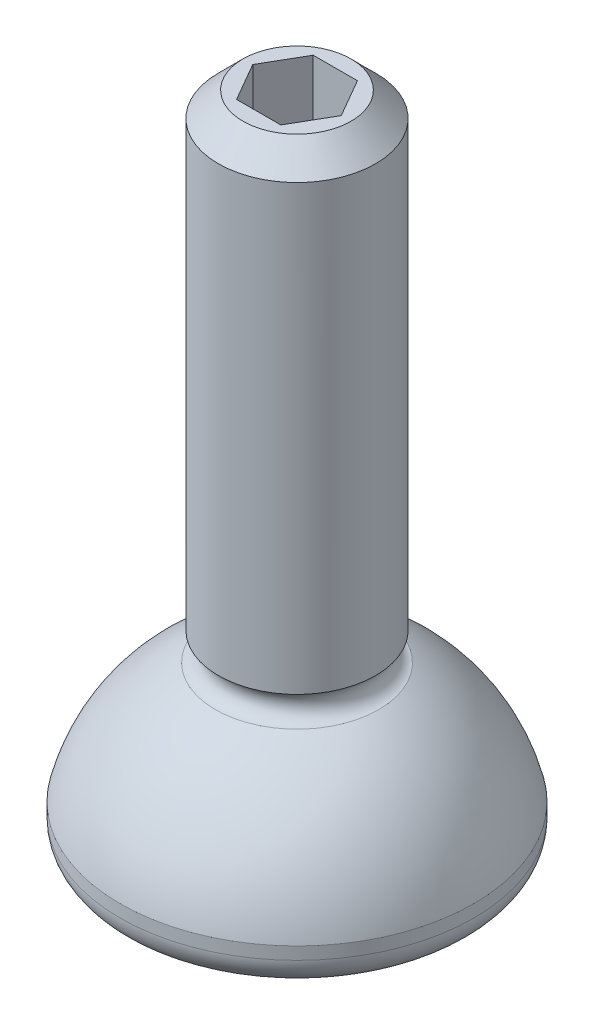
ISO-10303-21;
HEADER;
FILE_DESCRIPTION(('STEP AP214'),'2;1');
FILE_NAME('part.step','',(''),(''),'','','');
FILE_SCHEMA(('AUTOMOTIVE_DESIGN { 1 0 10303 214 1 1 1 1 }'));
ENDSEC;
DATA;
#1=APPLICATION_CONTEXT('core data for automotive mechanical design processes');
#2=APPLICATION_PROTOCOL_DEFINITION('international standard','automotive_design',2000,#1);
#3=PRODUCT_CONTEXT('',#1,'mechanical');
#4=PRODUCT('Part','Part','',(#3));
#5=PRODUCT_RELATED_PRODUCT_CATEGORY('part','',(#4));
#6=PRODUCT_DEFINITION_FORMATION('','',#4);
#7=PRODUCT_DEFINITION_CONTEXT('part definition',#1,'design');
#8=PRODUCT_DEFINITION('design','',#6,#7);
#9=PRODUCT_DEFINITION_SHAPE('','',#8);
#10=(LENGTH_UNIT() NAMED_UNIT(*) SI_UNIT(.MILLI.,.METRE.));
#11=(NAMED_UNIT(*) PLANE_ANGLE_UNIT() SI_UNIT($,.RADIAN.));
#12=(NAMED_UNIT(*) SI_UNIT($,.STERADIAN.) SOLID_ANGLE_UNIT());
#13=UNCERTAINTY_MEASURE_WITH_UNIT(LENGTH_MEASURE(1.E-05),#10,'distance_accuracy_value','');
#14=(GEOMETRIC_REPRESENTATION_CONTEXT(3) GLOBAL_UNCERTAINTY_ASSIGNED_CONTEXT((#13)) GLOBAL_UNIT_ASSIGNED_CONTEXT((#10,
#11,#12)) REPRESENTATION_CONTEXT('',''));
#15=CARTESIAN_POINT('',(0.,0.,0.));
#16=DIRECTION('',(0.,0.,1.));
#17=DIRECTION('',(1.,0.,0.));
#18=AXIS2_PLACEMENT_3D('',#15,#16,#17);
#19=CARTESIAN_POINT('',(3.49148336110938E-12,-1000.,0.));
#20=DIRECTION('',(0.,-1.,0.));
#21=DIRECTION('',(1.,0.,0.));
#22=AXIS2_PLACEMENT_3D('',#19,#20,#21);
#23=CYLINDRICAL_SURFACE('',#22,2.03200000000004);
#24=CARTESIAN_POINT('',(0.,4.92119226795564,0.));
#25=DIRECTION('',(0.,-1.,0.));
#26=DIRECTION('',(1.,0.,0.));
#27=AXIS2_PLACEMENT_3D('',#24,#25,#26);
#28=CIRCLE('',#27,2.03200000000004);
#29=CARTESIAN_POINT('',(2.03200000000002,4.92119226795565,0.));
#30=VERTEX_POINT('',#29);
#31=EDGE_CURVE('E36',#30,#30,#28,.T.);
#32=ORIENTED_EDGE('',*,*,#31,.F.);
#33=EDGE_LOOP('',(#32));
#34=FACE_BOUND('',#33,.T.);
#35=CARTESIAN_POINT('',(0.,16.383,0.));
#36=DIRECTION('',(0.,1.,0.));
#37=DIRECTION('',(-1.,0.,0.));
#38=AXIS2_PLACEMENT_3D('',#35,#36,#37);
#39=CIRCLE('',#38,2.03200000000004);
#40=CARTESIAN_POINT('',(-2.03200000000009,16.383,0.));
#41=VERTEX_POINT('',#40);
#42=EDGE_CURVE('E176',#41,#41,#39,.F.);
#43=ORIENTED_EDGE('',*,*,#42,.T.);
#44=EDGE_LOOP('',(#43));
#45=FACE_BOUND('',#44,.T.);
#46=ADVANCED_FACE('F32',(#34,#45),#23,.T.);
#47=CARTESIAN_POINT('',(2.032,17.018,0.));
#48=DIRECTION('',(0.,1.,0.));
#49=DIRECTION('',(-1.,0.,0.));
#50=AXIS2_PLACEMENT_3D('',#47,#48,#49);
#51=PLANE('',#50);
#52=DIRECTION('',(1.,0.,0.));
#53=VECTOR('',#52,1.);
#54=CARTESIAN_POINT('',(-0.571923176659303,17.018,0.9906));
#55=LINE('',#54,#53);
#56=CARTESIAN_POINT('',(-0.571923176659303,17.018,0.9906));
#57=VERTEX_POINT('',#56);
#58=CARTESIAN_POINT('',(0.571923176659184,17.018,0.9906));
#59=VERTEX_POINT('',#58);
#60=EDGE_CURVE('E154',#57,#59,#55,.T.);
#61=ORIENTED_EDGE('',*,*,#60,.F.);
#62=DIRECTION('',(0.5,0.,0.866025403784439));
#63=VECTOR('',#62,1.);
#64=CARTESIAN_POINT('',(-1.14384635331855,17.018,0.));
#65=LINE('',#64,#63);
#66=CARTESIAN_POINT('',(-1.14384635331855,17.018,0.));
#67=VERTEX_POINT('',#66);
#68=EDGE_CURVE('E152',#67,#57,#65,.T.);
#69=ORIENTED_EDGE('',*,*,#68,.F.);
#70=DIRECTION('',(-0.5,0.,0.866025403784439));
#71=VECTOR('',#70,1.);
#72=CARTESIAN_POINT('',(-0.571923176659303,17.018,-0.9906));
#73=LINE('',#72,#71);
#74=CARTESIAN_POINT('',(-0.571923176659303,17.018,-0.9906));
#75=VERTEX_POINT('',#74);
#76=EDGE_CURVE('E150',#75,#67,#73,.T.);
#77=ORIENTED_EDGE('',*,*,#76,.F.);
#78=DIRECTION('',(-1.,0.,0.));
#79=VECTOR('',#78,1.);
#80=CARTESIAN_POINT('',(0.571923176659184,17.018,-0.9906));
#81=LINE('',#80,#79);
#82=CARTESIAN_POINT('',(0.571923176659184,17.018,-0.9906));
#83=VERTEX_POINT('',#82);
#84=EDGE_CURVE('E147',#83,#75,#81,.T.);
#85=ORIENTED_EDGE('',*,*,#84,.F.);
#86=DIRECTION('',(-0.5,0.,-0.866025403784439));
#87=VECTOR('',#86,1.);
#88=CARTESIAN_POINT('',(1.14384635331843,17.018,0.));
#89=LINE('',#88,#87);
#90=CARTESIAN_POINT('',(1.14384635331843,17.018,0.));
#91=VERTEX_POINT('',#90);
#92=EDGE_CURVE('E118',#91,#83,#89,.T.);
#93=ORIENTED_EDGE('',*,*,#92,.F.);
#94=DIRECTION('',(0.5,0.,-0.866025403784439));
#95=VECTOR('',#94,1.);
#96=CARTESIAN_POINT('',(0.571923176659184,17.018,0.9906));
#97=LINE('',#96,#95);
#98=EDGE_CURVE('E111',#59,#91,#97,.T.);
#99=ORIENTED_EDGE('',*,*,#98,.F.);
#100=EDGE_LOOP('',(#61,#69,#77,#85,#93,#99));
#101=FACE_BOUND('',#100,.T.);
#102=CARTESIAN_POINT('',(0.,17.018,0.));
#103=DIRECTION('',(0.,1.,0.));
#104=DIRECTION('',(-1.,0.,0.));
#105=AXIS2_PLACEMENT_3D('',#102,#103,#104);
#106=CIRCLE('',#105,1.39699999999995);
#107=CARTESIAN_POINT('',(-1.39700000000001,17.018,0.));
#108=VERTEX_POINT('',#107);
#109=EDGE_CURVE('E179',#108,#108,#106,.T.);
#110=ORIENTED_EDGE('',*,*,#109,.T.);
#111=EDGE_LOOP('',(#110));
#112=FACE_BOUND('',#111,.T.);
#113=ADVANCED_FACE('F211',(#101,#112),#51,.T.);
#114=CARTESIAN_POINT('',(0.,16.383,0.));
#115=DIRECTION('',(0.,-1.,0.));
#116=DIRECTION('',(1.,0.,0.));
#117=AXIS2_PLACEMENT_3D('',#114,#115,#116);
#118=CONICAL_SURFACE('',#117,2.03200000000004,0.785398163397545);
#119=ORIENTED_EDGE('',*,*,#109,.F.);
#120=EDGE_LOOP('',(#119));
#121=FACE_BOUND('',#120,.T.);
#122=ORIENTED_EDGE('',*,*,#42,.F.);
#123=EDGE_LOOP('',(#122));
#124=FACE_BOUND('',#123,.T.);
#125=ADVANCED_FACE('F242',(#121,#124),#118,.T.);
#126=CARTESIAN_POINT('',(1.14384635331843,14.986,0.));
#127=DIRECTION('',(0.866025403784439,0.,-0.5));
#128=DIRECTION('',(-0.5,0.,-0.866025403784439));
#129=AXIS2_PLACEMENT_3D('',#126,#127,#128);
#130=PLANE('',#129);
#131=ORIENTED_EDGE('',*,*,#92,.T.);
#132=DIRECTION('',(0.,1.,0.));
#133=VECTOR('',#132,1.);
#134=CARTESIAN_POINT('',(0.571923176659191,14.986,-0.9906));
#135=LINE('',#134,#133);
#136=CARTESIAN_POINT('',(0.571923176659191,14.986,-0.9906));
#137=VERTEX_POINT('',#136);
#138=EDGE_CURVE('E114',#137,#83,#135,.T.);
#139=ORIENTED_EDGE('',*,*,#138,.F.);
#140=DIRECTION('',(-0.5,0.,-0.866025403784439));
#141=VECTOR('',#140,1.);
#142=CARTESIAN_POINT('',(1.14384635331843,14.986,0.));
#143=LINE('',#142,#141);
#144=CARTESIAN_POINT('',(0.857884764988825,14.986,-0.495299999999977));
#145=VERTEX_POINT('',#144);
#146=EDGE_CURVE('E103',#145,#137,#143,.T.);
#147=ORIENTED_EDGE('',*,*,#146,.F.);
#148=CARTESIAN_POINT('',(1.14384635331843,14.986,0.));
#149=VERTEX_POINT('',#148);
#150=EDGE_CURVE('E110',#149,#145,#143,.T.);
#151=ORIENTED_EDGE('',*,*,#150,.F.);
#152=DIRECTION('',(0.,1.,0.));
#153=VECTOR('',#152,1.);
#154=CARTESIAN_POINT('',(1.14384635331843,14.986,0.));
#155=LINE('',#154,#153);
#156=EDGE_CURVE('E157',#149,#91,#155,.T.);
#157=ORIENTED_EDGE('',*,*,#156,.T.);
#158=EDGE_LOOP('',(#131,#139,#147,#151,#157));
#159=FACE_BOUND('',#158,.T.);
#160=ADVANCED_FACE('F115',(#159),#130,.F.);
#161=CARTESIAN_POINT('',(0.571923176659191,14.986,0.9906));
#162=DIRECTION('',(0.866025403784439,0.,0.5));
#163=DIRECTION('',(0.5,0.,-0.866025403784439));
#164=AXIS2_PLACEMENT_3D('',#161,#162,#163);
#165=PLANE('',#164);
#166=ORIENTED_EDGE('',*,*,#98,.T.);
#167=ORIENTED_EDGE('',*,*,#156,.F.);
#168=DIRECTION('',(0.5,0.,-0.866025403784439));
#169=VECTOR('',#168,1.);
#170=CARTESIAN_POINT('',(0.571923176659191,14.986,0.9906));
#171=LINE('',#170,#169);
#172=CARTESIAN_POINT('',(0.857884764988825,14.986,0.495299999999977));
#173=VERTEX_POINT('',#172);
#174=EDGE_CURVE('E143',#173,#149,#171,.T.);
#175=ORIENTED_EDGE('',*,*,#174,.F.);
#176=CARTESIAN_POINT('',(0.571923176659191,14.986,0.9906));
#177=VERTEX_POINT('',#176);
#178=EDGE_CURVE('E122',#177,#173,#171,.T.);
#179=ORIENTED_EDGE('',*,*,#178,.F.);
#180=DIRECTION('',(0.,1.,0.));
#181=VECTOR('',#180,1.);
#182=CARTESIAN_POINT('',(0.571923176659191,14.986,0.9906));
#183=LINE('',#182,#181);
#184=EDGE_CURVE('E160',#177,#59,#183,.T.);
#185=ORIENTED_EDGE('',*,*,#184,.T.);
#186=EDGE_LOOP('',(#166,#167,#175,#179,#185));
#187=FACE_BOUND('',#186,.T.);
#188=ADVANCED_FACE('F265',(#187),#165,.F.);
#189=CARTESIAN_POINT('',(-0.571923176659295,14.986,0.9906));
#190=DIRECTION('',(0.,0.,1.));
#191=DIRECTION('',(1.,0.,0.));
#192=AXIS2_PLACEMENT_3D('',#189,#190,#191);
#193=PLANE('',#192);
#194=ORIENTED_EDGE('',*,*,#60,.T.);
#195=ORIENTED_EDGE('',*,*,#184,.F.);
#196=DIRECTION('',(1.,0.,0.));
#197=VECTOR('',#196,1.);
#198=CARTESIAN_POINT('',(-0.571923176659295,14.986,0.9906));
#199=LINE('',#198,#197);
#200=CARTESIAN_POINT('',(0.,14.986,0.9906));
#201=VERTEX_POINT('',#200);
#202=EDGE_CURVE('E139',#201,#177,#199,.T.);
#203=ORIENTED_EDGE('',*,*,#202,.F.);
#204=CARTESIAN_POINT('',(-0.571923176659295,14.986,0.9906));
#205=VERTEX_POINT('',#204);
#206=EDGE_CURVE('E140',#205,#201,#199,.T.);
#207=ORIENTED_EDGE('',*,*,#206,.F.);
#208=DIRECTION('',(0.,1.,0.));
#209=VECTOR('',#208,1.);
#210=CARTESIAN_POINT('',(-0.571923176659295,14.986,0.9906));
#211=LINE('',#210,#209);
#212=EDGE_CURVE('E163',#205,#57,#211,.T.);
#213=ORIENTED_EDGE('',*,*,#212,.T.);
#214=EDGE_LOOP('',(#194,#195,#203,#207,#213));
#215=FACE_BOUND('',#214,.T.);
#216=ADVANCED_FACE('F220',(#215),#193,.F.);
#217=CARTESIAN_POINT('',(-1.14384635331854,14.986,0.));
#218=DIRECTION('',(-0.866025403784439,0.,0.5));
#219=DIRECTION('',(0.5,0.,0.866025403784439));
#220=AXIS2_PLACEMENT_3D('',#217,#218,#219);
#221=PLANE('',#220);
#222=ORIENTED_EDGE('',*,*,#68,.T.);
#223=ORIENTED_EDGE('',*,*,#212,.F.);
#224=DIRECTION('',(0.5,0.,0.866025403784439));
#225=VECTOR('',#224,1.);
#226=CARTESIAN_POINT('',(-1.14384635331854,14.986,0.));
#227=LINE('',#226,#225);
#228=CARTESIAN_POINT('',(-0.857884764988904,14.986,0.495300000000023));
#229=VERTEX_POINT('',#228);
#230=EDGE_CURVE('E135',#229,#205,#227,.T.);
#231=ORIENTED_EDGE('',*,*,#230,.F.);
#232=CARTESIAN_POINT('',(-1.14384635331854,14.986,0.));
#233=VERTEX_POINT('',#232);
#234=EDGE_CURVE('E136',#233,#229,#227,.T.);
#235=ORIENTED_EDGE('',*,*,#234,.F.);
#236=DIRECTION('',(0.,1.,0.));
#237=VECTOR('',#236,1.);
#238=CARTESIAN_POINT('',(-1.14384635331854,14.986,0.));
#239=LINE('',#238,#237);
#240=EDGE_CURVE('E166',#233,#67,#239,.T.);
#241=ORIENTED_EDGE('',*,*,#240,.T.);
#242=EDGE_LOOP('',(#222,#223,#231,#235,#241));
#243=FACE_BOUND('',#242,.T.);
#244=ADVANCED_FACE('F216',(#243),#221,.F.);
#245=CARTESIAN_POINT('',(-0.571923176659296,14.986,-0.9906));
#246=DIRECTION('',(-0.866025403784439,0.,-0.5));
#247=DIRECTION('',(-0.5,0.,0.866025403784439));
#248=AXIS2_PLACEMENT_3D('',#245,#246,#247);
#249=PLANE('',#248);
#250=ORIENTED_EDGE('',*,*,#76,.T.);
#251=ORIENTED_EDGE('',*,*,#240,.F.);
#252=DIRECTION('',(-0.5,0.,0.866025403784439));
#253=VECTOR('',#252,1.);
#254=CARTESIAN_POINT('',(-0.571923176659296,14.986,-0.9906));
#255=LINE('',#254,#253);
#256=CARTESIAN_POINT('',(-0.857884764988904,14.986,-0.495300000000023));
#257=VERTEX_POINT('',#256);
#258=EDGE_CURVE('E128',#257,#233,#255,.T.);
#259=ORIENTED_EDGE('',*,*,#258,.F.);
#260=CARTESIAN_POINT('',(-0.571923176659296,14.986,-0.9906));
#261=VERTEX_POINT('',#260);
#262=EDGE_CURVE('E130',#261,#257,#255,.T.);
#263=ORIENTED_EDGE('',*,*,#262,.F.);
#264=DIRECTION('',(0.,1.,0.));
#265=VECTOR('',#264,1.);
#266=CARTESIAN_POINT('',(-0.571923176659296,14.986,-0.9906));
#267=LINE('',#266,#265);
#268=EDGE_CURVE('E121',#261,#75,#267,.T.);
#269=ORIENTED_EDGE('',*,*,#268,.T.);
#270=EDGE_LOOP('',(#250,#251,#259,#263,#269));
#271=FACE_BOUND('',#270,.T.);
#272=ADVANCED_FACE('F204',(#271),#249,.F.);
#273=CARTESIAN_POINT('',(0.571923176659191,14.986,-0.9906));
#274=DIRECTION('',(0.,0.,-1.));
#275=DIRECTION('',(-1.,0.,0.));
#276=AXIS2_PLACEMENT_3D('',#273,#274,#275);
#277=PLANE('',#276);
#278=ORIENTED_EDGE('',*,*,#84,.T.);
#279=ORIENTED_EDGE('',*,*,#268,.F.);
#280=DIRECTION('',(-1.,0.,0.));
#281=VECTOR('',#280,1.);
#282=CARTESIAN_POINT('',(0.571923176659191,14.986,-0.9906));
#283=LINE('',#282,#281);
#284=CARTESIAN_POINT('',(0.,14.986,-0.9906));
#285=VERTEX_POINT('',#284);
#286=EDGE_CURVE('E126',#285,#261,#283,.T.);
#287=ORIENTED_EDGE('',*,*,#286,.F.);
#288=EDGE_CURVE('E49',#137,#285,#283,.T.);
#289=ORIENTED_EDGE('',*,*,#288,.F.);
#290=ORIENTED_EDGE('',*,*,#138,.T.);
#291=EDGE_LOOP('',(#278,#279,#287,#289,#290));
#292=FACE_BOUND('',#291,.T.);
#293=ADVANCED_FACE('F124',(#292),#277,.F.);
#294=CARTESIAN_POINT('',(1.14384635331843,14.986,0.));
#295=DIRECTION('',(0.,-1.,0.));
#296=DIRECTION('',(0.,0.,-1.));
#297=AXIS2_PLACEMENT_3D('',#294,#295,#296);
#298=PLANE('',#297);
#299=ORIENTED_EDGE('',*,*,#286,.T.);
#300=ORIENTED_EDGE('',*,*,#262,.T.);
#301=CARTESIAN_POINT('',(0.,14.986,0.));
#302=DIRECTION('',(0.,-1.,0.));
#303=DIRECTION('',(0.,0.,-1.));
#304=AXIS2_PLACEMENT_3D('',#301,#302,#303);
#305=CIRCLE('',#304,0.990599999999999);
#306=EDGE_CURVE('E11',#285,#257,#305,.F.);
#307=ORIENTED_EDGE('',*,*,#306,.F.);
#308=EDGE_LOOP('',(#299,#300,#307));
#309=FACE_BOUND('',#308,.T.);
#310=ADVANCED_FACE('F206',(#309),#298,.F.);
#311=ORIENTED_EDGE('',*,*,#258,.T.);
#312=ORIENTED_EDGE('',*,*,#234,.T.);
#313=EDGE_CURVE('E41',#257,#229,#305,.F.);
#314=ORIENTED_EDGE('',*,*,#313,.F.);
#315=EDGE_LOOP('',(#311,#312,#314));
#316=FACE_BOUND('',#315,.T.);
#317=ADVANCED_FACE('F199',(#316),#298,.F.);
#318=ORIENTED_EDGE('',*,*,#230,.T.);
#319=ORIENTED_EDGE('',*,*,#206,.T.);
#320=EDGE_CURVE('E192',#229,#201,#305,.F.);
#321=ORIENTED_EDGE('',*,*,#320,.F.);
#322=EDGE_LOOP('',(#318,#319,#321));
#323=FACE_BOUND('',#322,.T.);
#324=ADVANCED_FACE('F224',(#323),#298,.F.);
#325=ORIENTED_EDGE('',*,*,#202,.T.);
#326=ORIENTED_EDGE('',*,*,#178,.T.);
#327=EDGE_CURVE('E190',#201,#173,#305,.F.);
#328=ORIENTED_EDGE('',*,*,#327,.F.);
#329=EDGE_LOOP('',(#325,#326,#328));
#330=FACE_BOUND('',#329,.T.);
#331=ADVANCED_FACE('F226',(#330),#298,.F.);
#332=ORIENTED_EDGE('',*,*,#174,.T.);
#333=ORIENTED_EDGE('',*,*,#150,.T.);
#334=EDGE_CURVE('E187',#173,#145,#305,.F.);
#335=ORIENTED_EDGE('',*,*,#334,.F.);
#336=EDGE_LOOP('',(#332,#333,#335));
#337=FACE_BOUND('',#336,.T.);
#338=ADVANCED_FACE('F232',(#337),#298,.F.);
#339=ORIENTED_EDGE('',*,*,#146,.T.);
#340=ORIENTED_EDGE('',*,*,#288,.T.);
#341=EDGE_CURVE('E42',#145,#285,#305,.F.);
#342=ORIENTED_EDGE('',*,*,#341,.F.);
#343=EDGE_LOOP('',(#339,#340,#342));
#344=FACE_BOUND('',#343,.T.);
#345=ADVANCED_FACE('F105',(#344),#298,.F.);
#346=CARTESIAN_POINT('',(0.,13.716,0.));
#347=DIRECTION('',(0.,1.,0.));
#348=DIRECTION('',(0.,0.,1.));
#349=AXIS2_PLACEMENT_3D('',#346,#347,#348);
#350=CONICAL_SURFACE('',#349,0.990599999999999,1.02974425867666);
#351=CARTESIAN_POINT('',(0.,13.1207874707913,0.));
#352=VERTEX_POINT('',#351);
#353=VERTEX_LOOP('',#352);
#354=FACE_BOUND('',#353,.T.);
#355=CARTESIAN_POINT('',(0.,13.716,0.));
#356=DIRECTION('',(0.,1.,0.));
#357=DIRECTION('',(0.,0.,1.));
#358=AXIS2_PLACEMENT_3D('',#355,#356,#357);
#359=CIRCLE('',#358,0.990599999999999);
#360=CARTESIAN_POINT('',(0.,13.716,0.990599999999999));
#361=VERTEX_POINT('',#360);
#362=EDGE_CURVE('E159',#361,#361,#359,.T.);
#363=ORIENTED_EDGE('',*,*,#362,.T.);
#364=EDGE_LOOP('',(#363));
#365=FACE_BOUND('',#364,.T.);
#366=ADVANCED_FACE('F278',(#354,#365),#350,.F.);
#367=CARTESIAN_POINT('',(0.,17.018,0.));
#368=DIRECTION('',(0.,1.,0.));
#369=DIRECTION('',(0.,0.,1.));
#370=AXIS2_PLACEMENT_3D('',#367,#368,#369);
#371=CYLINDRICAL_SURFACE('',#370,0.990599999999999);
#372=ORIENTED_EDGE('',*,*,#341,.T.);
#373=ORIENTED_EDGE('',*,*,#306,.T.);
#374=ORIENTED_EDGE('',*,*,#313,.T.);
#375=ORIENTED_EDGE('',*,*,#320,.T.);
#376=ORIENTED_EDGE('',*,*,#327,.T.);
#377=ORIENTED_EDGE('',*,*,#334,.T.);
#378=EDGE_LOOP('',(#372,#373,#374,#375,#376,#377));
#379=FACE_BOUND('',#378,.T.);
#380=ORIENTED_EDGE('',*,*,#362,.F.);
#381=EDGE_LOOP('',(#380));
#382=FACE_BOUND('',#381,.T.);
#383=ADVANCED_FACE('F195',(#379,#382),#371,.F.);
#384=CARTESIAN_POINT('',(0.,4.572,0.));
#385=DIRECTION('',(0.,-1.,0.));
#386=DIRECTION('',(1.,0.,0.));
#387=AXIS2_PLACEMENT_3D('',#384,#385,#386);
#388=TOROIDAL_SURFACE('',#387,2.18440000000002,0.381);
#389=CARTESIAN_POINT('',(0.,4.19814289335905,0.));
#390=DIRECTION('',(0.,-1.,0.));
#391=DIRECTION('',(1.,0.,0.));
#392=AXIS2_PLACEMENT_3D('',#389,#390,#391);
#393=CIRCLE('',#392,2.11097068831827);
#394=CARTESIAN_POINT('',(2.11097068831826,4.19814289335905,0.));
#395=VERTEX_POINT('',#394);
#396=EDGE_CURVE('E148',#395,#395,#393,.F.);
#397=ORIENTED_EDGE('',*,*,#396,.T.);
#398=EDGE_LOOP('',(#397));
#399=FACE_BOUND('',#398,.T.);
#400=ORIENTED_EDGE('',*,*,#31,.T.);
#401=EDGE_LOOP('',(#400));
#402=FACE_BOUND('',#401,.T.);
#403=ADVANCED_FACE('F258',(#399,#402),#388,.F.);
#404=CARTESIAN_POINT('',(0.,0.,0.));
#405=DIRECTION('',(0.,-1.,0.));
#406=DIRECTION('',(1.,0.,0.));
#407=AXIS2_PLACEMENT_3D('',#404,#405,#406);
#408=PLANE('',#407);
#409=CARTESIAN_POINT('',(0.,0.,0.));
#410=DIRECTION('',(0.,-1.,0.));
#411=DIRECTION('',(1.,0.,0.));
#412=AXIS2_PLACEMENT_3D('',#409,#410,#411);
#413=CIRCLE('',#412,3.81);
#414=CARTESIAN_POINT('',(3.81,0.,0.));
#415=VERTEX_POINT('',#414);
#416=EDGE_CURVE('E182',#415,#415,#413,.T.);
#417=ORIENTED_EDGE('',*,*,#416,.T.);
#418=EDGE_LOOP('',(#417));
#419=FACE_BOUND('',#418,.T.);
#420=ADVANCED_FACE('F256',(#419),#408,.T.);
#421=CARTESIAN_POINT('',(0.,0.761999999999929,0.));
#422=DIRECTION('',(0.,-1.,0.));
#423=DIRECTION('',(1.,0.,0.));
#424=AXIS2_PLACEMENT_3D('',#421,#422,#423);
#425=TOROIDAL_SURFACE('',#424,3.81,0.762);
#426=CARTESIAN_POINT('',(0.,0.761999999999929,0.));
#427=DIRECTION('',(0.,-1.,0.));
#428=DIRECTION('',(1.,0.,0.));
#429=AXIS2_PLACEMENT_3D('',#426,#427,#428);
#430=CIRCLE('',#429,4.572);
#431=CARTESIAN_POINT('',(4.572,0.761999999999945,0.));
#432=VERTEX_POINT('',#431);
#433=EDGE_CURVE('E185',#432,#432,#430,.F.);
#434=ORIENTED_EDGE('',*,*,#433,.F.);
#435=EDGE_LOOP('',(#434));
#436=FACE_BOUND('',#435,.T.);
#437=ORIENTED_EDGE('',*,*,#416,.F.);
#438=EDGE_LOOP('',(#437));
#439=FACE_BOUND('',#438,.T.);
#440=ADVANCED_FACE('F34',(#436,#439),#425,.T.);
#441=CARTESIAN_POINT('',(3.49148336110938E-12,-1000.,0.));
#442=DIRECTION('',(0.,-1.,0.));
#443=DIRECTION('',(1.,0.,0.));
#444=AXIS2_PLACEMENT_3D('',#441,#442,#443);
#445=CYLINDRICAL_SURFACE('',#444,4.572);
#446=ORIENTED_EDGE('',*,*,#433,.T.);
#447=EDGE_LOOP('',(#446));
#448=FACE_BOUND('',#447,.T.);
#449=CARTESIAN_POINT('',(0.,1.08508847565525,0.));
#450=DIRECTION('',(0.,-1.,0.));
#451=DIRECTION('',(1.,0.,0.));
#452=AXIS2_PLACEMENT_3D('',#449,#450,#451);
#453=CIRCLE('',#452,4.572);
#454=CARTESIAN_POINT('',(4.57200000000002,1.08508847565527,0.));
#455=VERTEX_POINT('',#454);
#456=EDGE_CURVE('E173',#455,#455,#453,.T.);
#457=ORIENTED_EDGE('',*,*,#456,.T.);
#458=EDGE_LOOP('',(#457));
#459=FACE_BOUND('',#458,.T.);
#460=ADVANCED_FACE('F251',(#448,#459),#445,.T.);
#461=CARTESIAN_POINT('',(0.,0.,0.));
#462=DIRECTION('',(0.,-1.,0.));
#463=DIRECTION('',(1.,0.,0.));
#464=AXIS2_PLACEMENT_3D('',#461,#462,#463);
#465=SPHERICAL_SURFACE('',#464,4.699);
#466=CARTESIAN_POINT('',(2.11097068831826,4.19814289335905,0.));
#467=CARTESIAN_POINT('',(2.14909784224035,4.1789714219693,0.));
#468=CARTESIAN_POINT('',(2.18696368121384,4.15928028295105,0.));
#469=CARTESIAN_POINT('',(2.26214494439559,4.11887388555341,0.));
#470=CARTESIAN_POINT('',(2.29946036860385,4.09815862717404,0.));
#471=CARTESIAN_POINT('',(2.37351301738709,4.05571920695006,0.));
#472=CARTESIAN_POINT('',(2.41025024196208,4.03399504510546,0.));
#473=CARTESIAN_POINT('',(2.48311924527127,3.98955398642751,0.));
#474=CARTESIAN_POINT('',(2.51925102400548,3.96683708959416,0.));
#475=CARTESIAN_POINT('',(2.59088230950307,3.92042741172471,0.));
#476=CARTESIAN_POINT('',(2.62638181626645,3.8967346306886,0.));
#477=CARTESIAN_POINT('',(2.69672220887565,3.84839077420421,0.));
#478=CARTESIAN_POINT('',(2.73156309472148,3.82373969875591,0.));
#479=CARTESIAN_POINT('',(2.80056038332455,3.77349755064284,0.));
#480=CARTESIAN_POINT('',(2.83471678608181,3.74790647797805,0.));
#481=CARTESIAN_POINT('',(2.9023197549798,3.69580333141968,0.));
#482=CARTESIAN_POINT('',(2.93576632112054,3.66929125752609,0.));
#483=CARTESIAN_POINT('',(3.00192479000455,3.61536578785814,0.));
#484=CARTESIAN_POINT('',(3.03463669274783,3.58795239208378,0.));
#485=CARTESIAN_POINT('',(3.09930155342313,3.53224462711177,0.));
#486=CARTESIAN_POINT('',(3.13125451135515,3.50395025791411,0.));
#487=CARTESIAN_POINT('',(3.19437776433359,3.44650154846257,0.));
#488=CARTESIAN_POINT('',(3.22554805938,3.41734720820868,0.));
#489=CARTESIAN_POINT('',(3.28708284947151,3.3582001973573,0.));
#490=CARTESIAN_POINT('',(3.3174473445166,3.3282075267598,0.));
#491=CARTESIAN_POINT('',(3.37734799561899,3.26740611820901,0.));
#492=CARTESIAN_POINT('',(3.40688415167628,3.23659738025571,0.));
#493=CARTESIAN_POINT('',(3.46510620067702,3.17418670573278,0.));
#494=CARTESIAN_POINT('',(3.49379209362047,3.14258476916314,0.));
#495=CARTESIAN_POINT('',(3.55029232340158,3.07861115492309,0.));
#496=CARTESIAN_POINT('',(3.57810666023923,3.04623947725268,0.));
#497=CARTESIAN_POINT('',(3.63284313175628,2.98075040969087,0.));
#498=CARTESIAN_POINT('',(3.65976526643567,2.94763301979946,0.));
#499=CARTESIAN_POINT('',(3.71269734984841,2.88067711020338,0.));
#500=CARTESIAN_POINT('',(3.73870729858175,2.8468385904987,0.));
#501=CARTESIAN_POINT('',(3.78979570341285,2.77846553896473,0.));
#502=CARTESIAN_POINT('',(3.8148741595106,2.74393100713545,0.));
#503=CARTESIAN_POINT('',(3.86408096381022,2.67419156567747,0.));
#504=CARTESIAN_POINT('',(3.88820931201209,2.63898665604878,0.));
#505=CARTESIAN_POINT('',(3.93549799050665,2.56793259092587,0.));
#506=CARTESIAN_POINT('',(3.95865832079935,2.53208343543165,0.));
#507=CARTESIAN_POINT('',(4.00399377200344,2.45976748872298,0.));
#508=CARTESIAN_POINT('',(4.02616889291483,2.42330069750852,0.));
#509=CARTESIAN_POINT('',(4.06951746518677,2.34977654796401,0.));
#510=CARTESIAN_POINT('',(4.09069091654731,2.31271918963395,0.));
#511=CARTESIAN_POINT('',(4.13202043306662,2.23804141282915,0.));
#512=CARTESIAN_POINT('',(4.1521764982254,2.20042099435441,0.));
#513=CARTESIAN_POINT('',(4.1914562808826,2.12464502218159,0.));
#514=CARTESIAN_POINT('',(4.21057999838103,2.0864894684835,0.));
#515=CARTESIAN_POINT('',(4.24778089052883,2.0096715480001,0.));
#516=CARTESIAN_POINT('',(4.26585806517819,1.97100918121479,0.));
#517=CARTESIAN_POINT('',(4.30095245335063,1.89320633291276,0.));
#518=CARTESIAN_POINT('',(4.31796966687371,1.85406585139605,0.));
#519=CARTESIAN_POINT('',(4.35093150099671,1.77533582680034,0.));
#520=CARTESIAN_POINT('',(4.36687612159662,1.73574628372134,0.));
#521=CARTESIAN_POINT('',(4.39768093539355,1.65614752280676,0.));
#522=CARTESIAN_POINT('',(4.41254112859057,1.61613830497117,0.));
#523=CARTESIAN_POINT('',(4.44116605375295,1.53572989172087,0.));
#524=CARTESIAN_POINT('',(4.45493078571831,1.49533069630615,0.));
#525=CARTESIAN_POINT('',(4.48135458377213,1.4141723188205,0.));
#526=CARTESIAN_POINT('',(4.49401364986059,1.37341313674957,0.));
#527=CARTESIAN_POINT('',(4.51821667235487,1.29156502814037,0.));
#528=CARTESIAN_POINT('',(4.52976062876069,1.2504761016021,0.));
#529=CARTESIAN_POINT('',(4.55172503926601,1.16799905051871,0.));
#530=CARTESIAN_POINT('',(4.56214549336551,1.12661092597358,0.));
#531=CARTESIAN_POINT('',(4.57200000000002,1.08508847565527,0.));
#532=B_SPLINE_CURVE_WITH_KNOTS('',3,(#466,#467,#468,#469,#470,#471,#472,#473,#474,#475,#476,
#477,#478,#479,#480,#481,#482,#483,#484,#485,#486,#487,#488,#489,#490,#491,#492,#493,#494,#495,
#496,#497,#498,#499,#500,#501,#502,#503,#504,#505,#506,#507,#508,#509,#510,#511,#512,#513,#514,
#515,#516,#517,#518,#519,#520,#521,#522,#523,#524,#525,#526,#527,#528,#529,#530,#531),
.UNSPECIFIED.,.F.,.F.,(4,2,2,2,2,2,2,2,2,2,2,2,2,2,2,2,2,2,2,2,2,2,2,2,2,2,2,2,2,2,2,2,4),(0.,
0.128023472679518,0.256046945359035,0.384070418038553,0.51209389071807,0.640117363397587,
0.768140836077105,0.896164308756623,1.02418778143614,1.15221125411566,1.28023472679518,
1.40825819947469,1.53628167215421,1.66430514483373,1.79232861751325,1.92035209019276,
2.04837556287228,2.1763990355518,2.30442250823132,2.43244598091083,2.56046945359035,
2.68849292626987,2.81651639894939,2.9445398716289,3.07256334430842,3.20058681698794,
3.32861028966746,3.45663376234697,3.58465723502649,3.71268070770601,3.84070418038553,
3.96872765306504,4.09675112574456),.UNSPECIFIED.);
#533=EDGE_CURVE('BSEAM248',#395,#455,#532,.T.);
#534=ORIENTED_EDGE('',*,*,#396,.F.);
#535=ORIENTED_EDGE('',*,*,#456,.F.);
#536=ORIENTED_EDGE('',*,*,#533,.T.);
#537=ORIENTED_EDGE('',*,*,#533,.F.);
#538=EDGE_LOOP('',(#534,#536,#535,#537));
#539=FACE_BOUND('',#538,.T.);
#540=ADVANCED_FACE('F248',(#539),#465,.T.);
#541=CLOSED_SHELL('',(#46,#113,#125,#160,#188,#216,#244,#272,#293,#310,#317,#324,#331,#338,#345,
#366,#383,#403,#420,#440,#460,#540));
#542=MANIFOLD_SOLID_BREP('B2',#541);
#543=ADVANCED_BREP_SHAPE_REPRESENTATION('',(#18,#542),#14);
#544=SHAPE_DEFINITION_REPRESENTATION(#9,#543);
ENDSEC;
END-ISO-10303-21;
